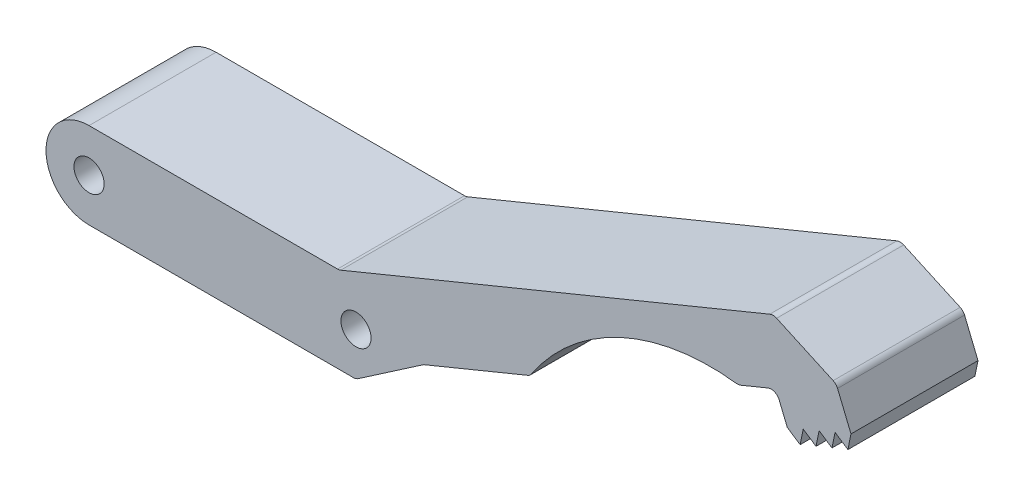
from build123d import *

# Parameters (mm, degrees)
SKETCH_1_R      = 1.75
EXTRUDE_1_DEPTH = 7.375
FILLET_1_R      = 1


with BuildPart() as part:
    # Sketch 1 → Extrude 1 (new, symmetric)
    with BuildSketch(Plane.XY):
        with BuildLine():
            Line((-9, 5), (20.05, 5))
            Line((20.05, 5), (70.455863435, 25.724355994))
            Line((70.455863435, 25.724355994), (77.772918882, 22.391441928))
            Line((77.772918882, 22.391441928), (79.484104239, 18.229489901))
            Line((79.484104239, 18.229489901), (79.124865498, 16.473475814))
            Line((79.124865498, 16.473475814), (77.634347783, 17.468963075))
            Line((77.634347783, 17.468963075), (77.275109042, 15.712948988))
            Line((77.275109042, 15.712948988), (75.784591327, 16.70843625))
            Line((75.784591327, 16.70843625), (75.425352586, 14.952422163))
            Line((75.425352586, 14.952422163), (73.93483487, 15.947909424))
            Line((73.93483487, 15.947909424), (73.575596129, 14.191895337))
            Line((73.575596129, 14.191895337), (72.085078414, 15.187382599))
            Line((72.085078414, 15.187382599), (70.761563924, 18.406439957))
            Line((70.761563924, 18.406439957), (66.42982236, 16.625445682))
            ThreePointArc((66.42982236, 16.625445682), (52.710898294, 14.550781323), (42.223162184, 5.466701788))
            Line((42.223162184, 5.466701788), (29.853914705, 0.381089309))
            Line((29.853914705, 0.381089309), (22, -5))
            Line((22, -5), (-9, -5))
            ThreePointArc((-9, -5), (-14, 0), (-9, 5))
        make_face()
        with Locations((-9, 0)):
            Circle(SKETCH_1_R, mode=Mode.SUBTRACT)
        with Locations((22, 0)):
            Circle(SKETCH_1_R, mode=Mode.SUBTRACT)
    extrude(amount=EXTRUDE_1_DEPTH, both=True)

    # Fillet 1
    fillet_1_edges = [part.edges().sort_by_distance(p)[0] for p in [
        (29.853914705, 0.381089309, 0),
        (22, -5, 0),
        (20.05, 5, 0),
        (70.455863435, 25.724355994, 0),
        (77.772918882, 22.391441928, 0),
        (70.761563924, 18.406439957, 0),
        (66.42982236, 16.625445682, 0),
        (42.223162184, 5.466701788, 0),
    ]]
    fillet(fillet_1_edges, radius=FILLET_1_R)


solid = part.part
